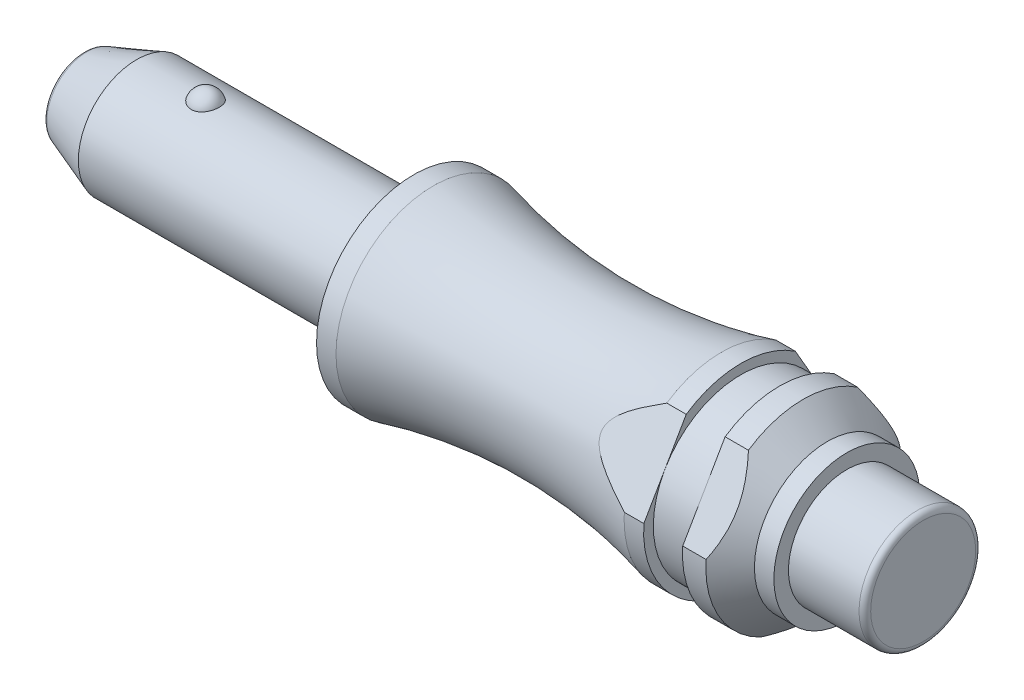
from build123d import *

# Parameters (mm, degrees)
SKETCH2_OUTSIDE_W   = 17.954
SKETCH2_OUTSIDE_H   = 17.954
EXTRUDE3_DEPTH      = 13.362
SKETCH3_R           = 3
BOSS_EXTRUDE1_DEPTH = 10
SKETCH3_2_R         = 3
BOSS_EXTRUDE2_DEPTH = 17
CHAMFER1_SIZE       = 2.75
CHAMFER1_SIZE2      = 1.000918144
FILLET1_R           = 0.3


with BuildPart() as part:
    # Sketch1 → Revolve1 (revolve)
    with BuildSketch(Plane.XY, mode=Mode.PRIVATE) as revolve1_sk:
        with BuildLine():
            Line((0, 0), (0, 5))
            Line((0, 5), (1, 5))
            ThreePointArc((1, 5), (8.41, 4.05), (15.82, 5))
            Line((15.82, 5), (16.82, 5))
            Line((16.82, 5), (16.82, 4.5))
            Line((16.82, 4.5), (18.82, 4.5))
            Line((18.82, 4.5), (18.82, 5))
            Line((18.82, 5), (20.02, 5))
            Line((20.02, 5), (21.27, 3.75))
            Line((21.27, 3.75), (22.27, 3.75))
            Line((22.27, 3.75), (22.27, 3))
            Line((22.27, 3), (26.2, 3))
            Line((26.2, 3), (26.2, 0))
            Line((26.2, 0), (0, 0))
        make_face()
    revolve(revolve1_sk.sketch.rotate(Axis((0, 0, 0), (1, 0, 0)), 90), axis=Axis((0, 0, 0), (1, 0, 0)))

    # Sketch2 outside → Extrude3 (cut)
    with BuildSketch(Plane(origin=(22.27, 0, 0), x_dir=(0, 0, -1), z_dir=(1, 0, 0))):
        Rectangle(SKETCH2_OUTSIDE_W, SKETCH2_OUTSIDE_H)
        Polygon((0, 9), (7.794228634, -4.5), (-7.794228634, -4.5), align=None, mode=Mode.SUBTRACT)
    extrude(amount=-EXTRUDE3_DEPTH, mode=Mode.SUBTRACT)

    # Sketch3 → Boss-Extrude1 (add)
    with BuildSketch(Plane.ZY):
        Circle(SKETCH3_R)
    extrude(amount=BOSS_EXTRUDE1_DEPTH)

    # Sketch4 → Revolve2 (revolve)
    with BuildSketch(Plane.XY):
        with BuildLine():
            Line((-9.957106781, -2.75), (-9.957106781, 2.75))
            ThreePointArc((-9.957106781, 2.75), (-10.176776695, 3.280330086), (-10.707106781, 3.5))
            Line((-10.707106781, 3.5), (-10.707106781, -3.5))
            ThreePointArc((-10.707106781, -3.5), (-10.176776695, -3.280330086), (-9.957106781, -2.75))
        make_face()
    revolve(axis=Axis((-10.707106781, 3.5, 0), (0, -1, 0)))

    # Sketch3_2 → Boss-Extrude2 (add)
    with BuildSketch(Plane.ZY):
        Circle(SKETCH3_2_R)
    extrude(amount=BOSS_EXTRUDE2_DEPTH)

    # Chamfer1
    chamfer1_edges = [part.edges().sort_by_distance(p)[0] for p in [
        (-17, 0, -3),
    ]]
    chamfer1_side = [part.faces().sort_by_distance(p)[0] for p in [
        (-8.5, 0, -3),
    ]]
    chamfer(chamfer1_edges, length=CHAMFER1_SIZE, length2=CHAMFER1_SIZE2, reference=chamfer1_side[0])

    # Fillet1
    fillet1_edges = [part.edges().sort_by_distance(p)[0] for p in [
        (-17, 0, -1.999081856),
        (26.2, 0, -3),
    ]]
    fillet(fillet1_edges, radius=FILLET1_R)


solid = part.part
